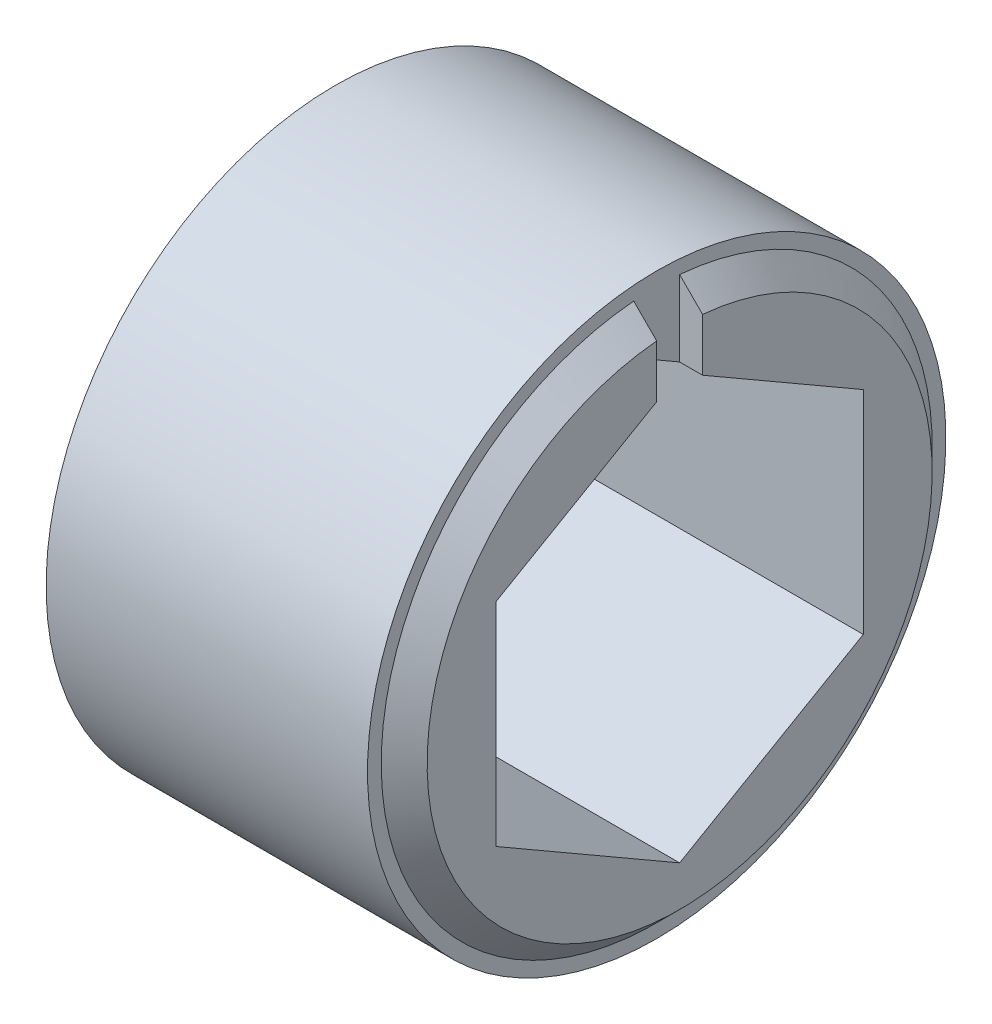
ISO-10303-21;
HEADER;
FILE_DESCRIPTION(('STEP AP214'),'2;1');
FILE_NAME('part.step','',(''),(''),'','','');
FILE_SCHEMA(('AUTOMOTIVE_DESIGN { 1 0 10303 214 1 1 1 1 }'));
ENDSEC;
DATA;
#1=APPLICATION_CONTEXT('core data for automotive mechanical design processes');
#2=APPLICATION_PROTOCOL_DEFINITION('international standard','automotive_design',2000,#1);
#3=PRODUCT_CONTEXT('',#1,'mechanical');
#4=PRODUCT('Part','Part','',(#3));
#5=PRODUCT_RELATED_PRODUCT_CATEGORY('part','',(#4));
#6=PRODUCT_DEFINITION_FORMATION('','',#4);
#7=PRODUCT_DEFINITION_CONTEXT('part definition',#1,'design');
#8=PRODUCT_DEFINITION('design','',#6,#7);
#9=PRODUCT_DEFINITION_SHAPE('','',#8);
#10=(LENGTH_UNIT() NAMED_UNIT(*) SI_UNIT(.MILLI.,.METRE.));
#11=(NAMED_UNIT(*) PLANE_ANGLE_UNIT() SI_UNIT($,.RADIAN.));
#12=(NAMED_UNIT(*) SI_UNIT($,.STERADIAN.) SOLID_ANGLE_UNIT());
#13=UNCERTAINTY_MEASURE_WITH_UNIT(LENGTH_MEASURE(1.E-05),#10,'distance_accuracy_value','');
#14=(GEOMETRIC_REPRESENTATION_CONTEXT(3) GLOBAL_UNCERTAINTY_ASSIGNED_CONTEXT((#13)) GLOBAL_UNIT_ASSIGNED_CONTEXT((#10,
#11,#12)) REPRESENTATION_CONTEXT('',''));
#15=CARTESIAN_POINT('',(0.,0.,0.));
#16=DIRECTION('',(0.,0.,1.));
#17=DIRECTION('',(1.,0.,0.));
#18=AXIS2_PLACEMENT_3D('',#15,#16,#17);
#19=CARTESIAN_POINT('',(6.35,0.,0.));
#20=DIRECTION('',(-1.,0.,0.));
#21=DIRECTION('',(0.,-1.,0.));
#22=AXIS2_PLACEMENT_3D('',#19,#20,#21);
#23=CONICAL_SURFACE('',#22,8.73125,0.785398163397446);
#24=CARTESIAN_POINT('',(6.35,0.,0.));
#25=DIRECTION('',(1.,0.,0.));
#26=DIRECTION('',(0.,1.,0.));
#27=AXIS2_PLACEMENT_3D('',#24,#25,#26);
#28=CIRCLE('',#27,8.73125);
#29=CARTESIAN_POINT('',(6.35,8.69509560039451,0.79375));
#30=VERTEX_POINT('',#29);
#31=CARTESIAN_POINT('',(6.35,8.69509560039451,-0.79375));
#32=VERTEX_POINT('',#31);
#33=EDGE_CURVE('E302',#30,#32,#28,.T.);
#34=ORIENTED_EDGE('',*,*,#33,.F.);
#35=CARTESIAN_POINT('',(-2378.57297857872,-2366.38302238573,0.79375));
#36=DIRECTION('',(0.,0.,1.));
#37=DIRECTION('',(0.708567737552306,0.705642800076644,0.));
#38=AXIS2_PLACEMENT_3D('',#35,#36,#37);
#39=CIRCLE('',#38,3365.83625274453);
#40=CARTESIAN_POINT('',(5.55625,9.49186946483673,0.79375));
#41=VERTEX_POINT('',#40);
#42=EDGE_CURVE('E254',#30,#41,#39,.T.);
#43=ORIENTED_EDGE('',*,*,#42,.T.);
#44=CARTESIAN_POINT('',(5.55625,0.,0.));
#45=DIRECTION('',(-1.,0.,0.));
#46=DIRECTION('',(0.,1.,0.));
#47=AXIS2_PLACEMENT_3D('',#44,#45,#46);
#48=CIRCLE('',#47,9.525);
#49=CARTESIAN_POINT('',(5.55625,9.49186946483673,-0.79375));
#50=VERTEX_POINT('',#49);
#51=EDGE_CURVE('E182',#50,#41,#48,.T.);
#52=ORIENTED_EDGE('',*,*,#51,.F.);
#53=CARTESIAN_POINT('',(-2378.57296923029,-2366.38301307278,-0.79375));
#54=DIRECTION('',(0.,0.,-1.));
#55=DIRECTION('',(0.708331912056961,0.705879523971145,0.));
#56=AXIS2_PLACEMENT_3D('',#53,#54,#55);
#57=CIRCLE('',#56,3365.83623954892);
#58=EDGE_CURVE('E173',#50,#32,#57,.T.);
#59=ORIENTED_EDGE('',*,*,#58,.T.);
#60=EDGE_LOOP('',(#34,#43,#52,#59));
#61=FACE_BOUND('',#60,.T.);
#62=ADVANCED_FACE('F17',(#61),#23,.T.);
#63=CARTESIAN_POINT('',(-6.36,0.,0.));
#64=DIRECTION('',(1.,0.,0.));
#65=DIRECTION('',(0.,1.,0.));
#66=AXIS2_PLACEMENT_3D('',#63,#64,#65);
#67=CYLINDRICAL_SURFACE('',#66,10.);
#68=CARTESIAN_POINT('',(-5.55625,0.,0.));
#69=DIRECTION('',(1.,0.,0.));
#70=DIRECTION('',(0.,1.,0.));
#71=AXIS2_PLACEMENT_3D('',#68,#69,#70);
#72=CIRCLE('',#71,10.);
#73=CARTESIAN_POINT('',(-5.55625,10.,0.));
#74=VERTEX_POINT('',#73);
#75=EDGE_CURVE('E156',#74,#74,#72,.T.);
#76=ORIENTED_EDGE('',*,*,#75,.T.);
#77=EDGE_LOOP('',(#76));
#78=FACE_BOUND('',#77,.T.);
#79=CARTESIAN_POINT('',(5.55625,0.,0.));
#80=DIRECTION('',(1.,0.,0.));
#81=DIRECTION('',(0.,1.,0.));
#82=AXIS2_PLACEMENT_3D('',#79,#80,#81);
#83=CIRCLE('',#82,10.);
#84=CARTESIAN_POINT('',(5.55625,10.,0.));
#85=VERTEX_POINT('',#84);
#86=EDGE_CURVE('E187',#85,#85,#83,.T.);
#87=ORIENTED_EDGE('',*,*,#86,.F.);
#88=EDGE_LOOP('',(#87));
#89=FACE_BOUND('',#88,.T.);
#90=ADVANCED_FACE('F157',(#78,#89),#67,.T.);
#91=CARTESIAN_POINT('',(-6.35,-3.66617420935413,6.35));
#92=DIRECTION('',(0.,-0.866025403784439,0.5));
#93=DIRECTION('',(-1.,0.,0.));
#94=AXIS2_PLACEMENT_3D('',#91,#92,#93);
#95=PLANE('',#94);
#96=DIRECTION('',(0.,-0.5,-0.866025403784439));
#97=VECTOR('',#96,1.);
#98=CARTESIAN_POINT('',(6.35,-3.66617420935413,6.35));
#99=LINE('',#98,#97);
#100=CARTESIAN_POINT('',(6.35,-3.66617420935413,6.35));
#101=VERTEX_POINT('',#100);
#102=CARTESIAN_POINT('',(6.35,-7.33234841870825,0.));
#103=VERTEX_POINT('',#102);
#104=EDGE_CURVE('E270',#101,#103,#99,.T.);
#105=ORIENTED_EDGE('',*,*,#104,.T.);
#106=DIRECTION('',(1.,0.,0.));
#107=VECTOR('',#106,1.);
#108=CARTESIAN_POINT('',(-6.35,-7.33234841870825,0.));
#109=LINE('',#108,#107);
#110=CARTESIAN_POINT('',(-6.35,-7.33234841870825,0.));
#111=VERTEX_POINT('',#110);
#112=EDGE_CURVE('E11',#111,#103,#109,.T.);
#113=ORIENTED_EDGE('',*,*,#112,.F.);
#114=DIRECTION('',(0.,-0.5,-0.866025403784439));
#115=VECTOR('',#114,1.);
#116=CARTESIAN_POINT('',(-6.35,-3.66617420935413,6.35));
#117=LINE('',#116,#115);
#118=CARTESIAN_POINT('',(-6.35,-3.66617420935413,6.35));
#119=VERTEX_POINT('',#118);
#120=EDGE_CURVE('E205',#119,#111,#117,.T.);
#121=ORIENTED_EDGE('',*,*,#120,.F.);
#122=DIRECTION('',(1.,0.,0.));
#123=VECTOR('',#122,1.);
#124=CARTESIAN_POINT('',(-6.35,-3.66617420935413,6.35));
#125=LINE('',#124,#123);
#126=EDGE_CURVE('E206',#119,#101,#125,.T.);
#127=ORIENTED_EDGE('',*,*,#126,.T.);
#128=EDGE_LOOP('',(#105,#113,#121,#127));
#129=FACE_BOUND('',#128,.T.);
#130=ADVANCED_FACE('F355',(#129),#95,.F.);
#131=CARTESIAN_POINT('',(-6.35,-7.33234841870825,0.));
#132=DIRECTION('',(0.,-0.866025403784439,-0.5));
#133=DIRECTION('',(0.,0.5,-0.866025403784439));
#134=AXIS2_PLACEMENT_3D('',#131,#132,#133);
#135=PLANE('',#134);
#136=DIRECTION('',(0.,0.5,-0.866025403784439));
#137=VECTOR('',#136,1.);
#138=CARTESIAN_POINT('',(6.35,-7.33234841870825,0.));
#139=LINE('',#138,#137);
#140=CARTESIAN_POINT('',(6.35,-3.66617420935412,-6.35));
#141=VERTEX_POINT('',#140);
#142=EDGE_CURVE('E267',#103,#141,#139,.T.);
#143=ORIENTED_EDGE('',*,*,#142,.T.);
#144=DIRECTION('',(1.,0.,0.));
#145=VECTOR('',#144,1.);
#146=CARTESIAN_POINT('',(-6.35,-3.66617420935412,-6.35));
#147=LINE('',#146,#145);
#148=CARTESIAN_POINT('',(-6.35,-3.66617420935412,-6.35));
#149=VERTEX_POINT('',#148);
#150=EDGE_CURVE('E25',#149,#141,#147,.T.);
#151=ORIENTED_EDGE('',*,*,#150,.F.);
#152=DIRECTION('',(0.,0.5,-0.866025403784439));
#153=VECTOR('',#152,1.);
#154=CARTESIAN_POINT('',(-6.35,-7.33234841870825,0.));
#155=LINE('',#154,#153);
#156=EDGE_CURVE('E293',#111,#149,#155,.T.);
#157=ORIENTED_EDGE('',*,*,#156,.F.);
#158=ORIENTED_EDGE('',*,*,#112,.T.);
#159=EDGE_LOOP('',(#143,#151,#157,#158));
#160=FACE_BOUND('',#159,.T.);
#161=ADVANCED_FACE('F360',(#160),#135,.F.);
#162=CARTESIAN_POINT('',(-6.35,-3.66617420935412,-6.35));
#163=DIRECTION('',(0.,0.,-1.));
#164=DIRECTION('',(-1.,0.,0.));
#165=AXIS2_PLACEMENT_3D('',#162,#163,#164);
#166=PLANE('',#165);
#167=DIRECTION('',(0.,1.,0.));
#168=VECTOR('',#167,1.);
#169=CARTESIAN_POINT('',(6.35,-3.66617420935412,-6.35));
#170=LINE('',#169,#168);
#171=CARTESIAN_POINT('',(6.35,3.66617420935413,-6.35));
#172=VERTEX_POINT('',#171);
#173=EDGE_CURVE('E271',#141,#172,#170,.T.);
#174=ORIENTED_EDGE('',*,*,#173,.T.);
#175=DIRECTION('',(1.,0.,0.));
#176=VECTOR('',#175,1.);
#177=CARTESIAN_POINT('',(-6.35,3.66617420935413,-6.35));
#178=LINE('',#177,#176);
#179=CARTESIAN_POINT('',(-6.35,3.66617420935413,-6.35));
#180=VERTEX_POINT('',#179);
#181=EDGE_CURVE('E278',#180,#172,#178,.T.);
#182=ORIENTED_EDGE('',*,*,#181,.F.);
#183=DIRECTION('',(0.,1.,0.));
#184=VECTOR('',#183,1.);
#185=CARTESIAN_POINT('',(-6.35,-3.66617420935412,-6.35));
#186=LINE('',#185,#184);
#187=EDGE_CURVE('E281',#149,#180,#186,.T.);
#188=ORIENTED_EDGE('',*,*,#187,.F.);
#189=ORIENTED_EDGE('',*,*,#150,.T.);
#190=EDGE_LOOP('',(#174,#182,#188,#189));
#191=FACE_BOUND('',#190,.T.);
#192=ADVANCED_FACE('F321',(#191),#166,.F.);
#193=CARTESIAN_POINT('',(-6.35,0.,0.));
#194=DIRECTION('',(1.,0.,0.));
#195=DIRECTION('',(0.,1.,0.));
#196=AXIS2_PLACEMENT_3D('',#193,#194,#195);
#197=PLANE('',#196);
#198=DIRECTION('',(0.,0.5,0.866025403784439));
#199=VECTOR('',#198,1.);
#200=CARTESIAN_POINT('',(-6.35,3.66617420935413,-6.35));
#201=LINE('',#200,#199);
#202=CARTESIAN_POINT('',(-6.35,6.87407664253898,-0.79375));
#203=VERTEX_POINT('',#202);
#204=EDGE_CURVE('E275',#180,#203,#201,.T.);
#205=ORIENTED_EDGE('',*,*,#204,.T.);
#206=DIRECTION('',(0.,-1.,0.));
#207=VECTOR('',#206,1.);
#208=CARTESIAN_POINT('',(-6.35,6.87407664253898,-0.79375));
#209=LINE('',#208,#207);
#210=CARTESIAN_POINT('',(-6.35,8.69509560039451,-0.79375));
#211=VERTEX_POINT('',#210);
#212=EDGE_CURVE('E192',#211,#203,#209,.T.);
#213=ORIENTED_EDGE('',*,*,#212,.F.);
#214=CARTESIAN_POINT('',(-6.35,0.,0.));
#215=DIRECTION('',(1.,0.,0.));
#216=DIRECTION('',(0.,1.,0.));
#217=AXIS2_PLACEMENT_3D('',#214,#215,#216);
#218=CIRCLE('',#217,8.73125);
#219=CARTESIAN_POINT('',(-6.35,8.69509560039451,0.79375));
#220=VERTEX_POINT('',#219);
#221=EDGE_CURVE('E210',#220,#211,#218,.T.);
#222=ORIENTED_EDGE('',*,*,#221,.F.);
#223=DIRECTION('',(0.,1.,0.));
#224=VECTOR('',#223,1.);
#225=CARTESIAN_POINT('',(-6.35,6.87407664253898,0.79375));
#226=LINE('',#225,#224);
#227=CARTESIAN_POINT('',(-6.35,6.87407664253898,0.79375));
#228=VERTEX_POINT('',#227);
#229=EDGE_CURVE('E175',#228,#220,#226,.T.);
#230=ORIENTED_EDGE('',*,*,#229,.F.);
#231=DIRECTION('',(0.,-0.5,0.866025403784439));
#232=VECTOR('',#231,1.);
#233=CARTESIAN_POINT('',(-6.35,7.33234841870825,0.));
#234=LINE('',#233,#232);
#235=CARTESIAN_POINT('',(-6.35,3.66617420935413,6.35));
#236=VERTEX_POINT('',#235);
#237=EDGE_CURVE('E246',#228,#236,#234,.T.);
#238=ORIENTED_EDGE('',*,*,#237,.T.);
#239=DIRECTION('',(0.,-1.,0.));
#240=VECTOR('',#239,1.);
#241=CARTESIAN_POINT('',(-6.35,3.66617420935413,6.35));
#242=LINE('',#241,#240);
#243=EDGE_CURVE('E201',#236,#119,#242,.T.);
#244=ORIENTED_EDGE('',*,*,#243,.T.);
#245=ORIENTED_EDGE('',*,*,#120,.T.);
#246=ORIENTED_EDGE('',*,*,#156,.T.);
#247=ORIENTED_EDGE('',*,*,#187,.T.);
#248=EDGE_LOOP('',(#205,#213,#222,#230,#238,#244,#245,#246,#247));
#249=FACE_BOUND('',#248,.T.);
#250=ADVANCED_FACE('F318',(#249),#197,.F.);
#251=CARTESIAN_POINT('',(-6.35,3.66617420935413,6.35));
#252=DIRECTION('',(0.,0.,1.));
#253=DIRECTION('',(1.,0.,0.));
#254=AXIS2_PLACEMENT_3D('',#251,#252,#253);
#255=PLANE('',#254);
#256=DIRECTION('',(0.,-1.,0.));
#257=VECTOR('',#256,1.);
#258=CARTESIAN_POINT('',(6.35,3.66617420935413,6.35));
#259=LINE('',#258,#257);
#260=CARTESIAN_POINT('',(6.35,3.66617420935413,6.35));
#261=VERTEX_POINT('',#260);
#262=EDGE_CURVE('E241',#261,#101,#259,.T.);
#263=ORIENTED_EDGE('',*,*,#262,.T.);
#264=ORIENTED_EDGE('',*,*,#126,.F.);
#265=ORIENTED_EDGE('',*,*,#243,.F.);
#266=DIRECTION('',(1.,0.,0.));
#267=VECTOR('',#266,1.);
#268=CARTESIAN_POINT('',(-6.35,3.66617420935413,6.35));
#269=LINE('',#268,#267);
#270=EDGE_CURVE('E242',#236,#261,#269,.T.);
#271=ORIENTED_EDGE('',*,*,#270,.T.);
#272=EDGE_LOOP('',(#263,#264,#265,#271));
#273=FACE_BOUND('',#272,.T.);
#274=ADVANCED_FACE('F353',(#273),#255,.F.);
#275=CARTESIAN_POINT('',(6.35,0.,0.));
#276=DIRECTION('',(1.,0.,0.));
#277=DIRECTION('',(0.,1.,0.));
#278=AXIS2_PLACEMENT_3D('',#275,#276,#277);
#279=PLANE('',#278);
#280=DIRECTION('',(0.,-1.,0.));
#281=VECTOR('',#280,1.);
#282=CARTESIAN_POINT('',(6.35,6.87407664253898,0.79375));
#283=LINE('',#282,#281);
#284=CARTESIAN_POINT('',(6.35,6.87407664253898,0.79375));
#285=VERTEX_POINT('',#284);
#286=EDGE_CURVE('E227',#30,#285,#283,.T.);
#287=ORIENTED_EDGE('',*,*,#286,.F.);
#288=ORIENTED_EDGE('',*,*,#33,.T.);
#289=DIRECTION('',(0.,1.,0.));
#290=VECTOR('',#289,1.);
#291=CARTESIAN_POINT('',(6.35,6.87407664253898,-0.79375));
#292=LINE('',#291,#290);
#293=CARTESIAN_POINT('',(6.35,6.87407664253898,-0.79375));
#294=VERTEX_POINT('',#293);
#295=EDGE_CURVE('E176',#294,#32,#292,.T.);
#296=ORIENTED_EDGE('',*,*,#295,.F.);
#297=DIRECTION('',(0.,0.5,0.866025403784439));
#298=VECTOR('',#297,1.);
#299=CARTESIAN_POINT('',(6.35,3.66617420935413,-6.35));
#300=LINE('',#299,#298);
#301=EDGE_CURVE('E285',#172,#294,#300,.T.);
#302=ORIENTED_EDGE('',*,*,#301,.F.);
#303=ORIENTED_EDGE('',*,*,#173,.F.);
#304=ORIENTED_EDGE('',*,*,#142,.F.);
#305=ORIENTED_EDGE('',*,*,#104,.F.);
#306=ORIENTED_EDGE('',*,*,#262,.F.);
#307=DIRECTION('',(0.,-0.5,0.866025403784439));
#308=VECTOR('',#307,1.);
#309=CARTESIAN_POINT('',(6.35,7.33234841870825,0.));
#310=LINE('',#309,#308);
#311=EDGE_CURVE('E247',#285,#261,#310,.T.);
#312=ORIENTED_EDGE('',*,*,#311,.F.);
#313=EDGE_LOOP('',(#287,#288,#296,#302,#303,#304,#305,#306,#312));
#314=FACE_BOUND('',#313,.T.);
#315=ADVANCED_FACE('F359',(#314),#279,.T.);
#316=CARTESIAN_POINT('',(-2.46633885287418,6.87407664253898,0.79375));
#317=DIRECTION('',(0.,0.,1.));
#318=DIRECTION('',(1.,0.,0.));
#319=AXIS2_PLACEMENT_3D('',#316,#317,#318);
#320=PLANE('',#319);
#321=DIRECTION('',(0.,1.,0.));
#322=VECTOR('',#321,1.);
#323=CARTESIAN_POINT('',(-5.55625,6.87407664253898,0.79375));
#324=LINE('',#323,#322);
#325=CARTESIAN_POINT('',(-5.55625,6.87407664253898,0.79375));
#326=VERTEX_POINT('',#325);
#327=CARTESIAN_POINT('',(-5.55625,9.49186946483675,0.79375));
#328=VERTEX_POINT('',#327);
#329=EDGE_CURVE('E172',#326,#328,#324,.T.);
#330=ORIENTED_EDGE('',*,*,#329,.F.);
#331=DIRECTION('',(-1.,0.,0.));
#332=VECTOR('',#331,1.);
#333=CARTESIAN_POINT('',(-2.46633885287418,6.87407664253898,0.79375));
#334=LINE('',#333,#332);
#335=EDGE_CURVE('E257',#326,#228,#334,.T.);
#336=ORIENTED_EDGE('',*,*,#335,.T.);
#337=ORIENTED_EDGE('',*,*,#229,.T.);
#338=CARTESIAN_POINT('',(2378.57294995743,-2366.38299387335,0.79375));
#339=DIRECTION('',(0.,0.,1.));
#340=DIRECTION('',(-0.708331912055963,0.705879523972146,0.));
#341=AXIS2_PLACEMENT_3D('',#338,#339,#340);
#342=CIRCLE('',#341,3365.83621234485);
#343=EDGE_CURVE('E197',#328,#220,#342,.T.);
#344=ORIENTED_EDGE('',*,*,#343,.F.);
#345=EDGE_LOOP('',(#330,#336,#337,#344));
#346=FACE_BOUND('',#345,.T.);
#347=ADVANCED_FACE('F339',(#346),#320,.F.);
#348=CARTESIAN_POINT('',(2.46633885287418,6.87407664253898,-0.79375));
#349=DIRECTION('',(0.,0.,-1.));
#350=DIRECTION('',(0.,-1.,0.));
#351=AXIS2_PLACEMENT_3D('',#348,#349,#350);
#352=PLANE('',#351);
#353=DIRECTION('',(0.,-1.,0.));
#354=VECTOR('',#353,1.);
#355=CARTESIAN_POINT('',(5.55625,6.87407664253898,-0.79375));
#356=LINE('',#355,#354);
#357=CARTESIAN_POINT('',(5.55625,6.87407664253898,-0.79375));
#358=VERTEX_POINT('',#357);
#359=EDGE_CURVE('E232',#50,#358,#356,.T.);
#360=ORIENTED_EDGE('',*,*,#359,.T.);
#361=DIRECTION('',(1.,0.,0.));
#362=VECTOR('',#361,1.);
#363=CARTESIAN_POINT('',(2.46633885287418,6.87407664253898,-0.79375));
#364=LINE('',#363,#362);
#365=EDGE_CURVE('E289',#358,#294,#364,.T.);
#366=ORIENTED_EDGE('',*,*,#365,.T.);
#367=ORIENTED_EDGE('',*,*,#295,.T.);
#368=ORIENTED_EDGE('',*,*,#58,.F.);
#369=EDGE_LOOP('',(#360,#366,#367,#368));
#370=FACE_BOUND('',#369,.T.);
#371=ADVANCED_FACE('F389',(#370),#352,.F.);
#372=CARTESIAN_POINT('',(-6.35,3.66617420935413,-6.35));
#373=DIRECTION('',(0.,0.866025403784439,-0.5));
#374=DIRECTION('',(-1.,0.,0.));
#375=AXIS2_PLACEMENT_3D('',#372,#373,#374);
#376=PLANE('',#375);
#377=DIRECTION('',(1.,0.,0.));
#378=VECTOR('',#377,1.);
#379=CARTESIAN_POINT('',(-6.35,7.33234841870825,0.));
#380=LINE('',#379,#378);
#381=CARTESIAN_POINT('',(-5.55625,7.33234841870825,0.));
#382=VERTEX_POINT('',#381);
#383=CARTESIAN_POINT('',(5.55625,7.33234841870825,0.));
#384=VERTEX_POINT('',#383);
#385=EDGE_CURVE('E261',#382,#384,#380,.T.);
#386=ORIENTED_EDGE('',*,*,#385,.F.);
#387=DIRECTION('',(0.,-0.5,-0.866025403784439));
#388=VECTOR('',#387,1.);
#389=CARTESIAN_POINT('',(-5.55625,3.66617420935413,-6.35));
#390=LINE('',#389,#388);
#391=CARTESIAN_POINT('',(-5.55625,6.87407664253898,-0.79375));
#392=VERTEX_POINT('',#391);
#393=EDGE_CURVE('E181',#382,#392,#390,.T.);
#394=ORIENTED_EDGE('',*,*,#393,.T.);
#395=DIRECTION('',(-1.,0.,0.));
#396=VECTOR('',#395,1.);
#397=CARTESIAN_POINT('',(-2.46633885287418,6.87407664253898,-0.79375));
#398=LINE('',#397,#396);
#399=EDGE_CURVE('E196',#392,#203,#398,.T.);
#400=ORIENTED_EDGE('',*,*,#399,.T.);
#401=ORIENTED_EDGE('',*,*,#204,.F.);
#402=ORIENTED_EDGE('',*,*,#181,.T.);
#403=ORIENTED_EDGE('',*,*,#301,.T.);
#404=ORIENTED_EDGE('',*,*,#365,.F.);
#405=DIRECTION('',(0.,-0.5,-0.866025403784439));
#406=VECTOR('',#405,1.);
#407=CARTESIAN_POINT('',(5.55625,3.66617420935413,-6.35));
#408=LINE('',#407,#406);
#409=EDGE_CURVE('E224',#384,#358,#408,.T.);
#410=ORIENTED_EDGE('',*,*,#409,.F.);
#411=EDGE_LOOP('',(#386,#394,#400,#401,#402,#403,#404,#410));
#412=FACE_BOUND('',#411,.T.);
#413=ADVANCED_FACE('F325',(#412),#376,.F.);
#414=CARTESIAN_POINT('',(-6.35,7.33234841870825,0.));
#415=DIRECTION('',(0.,0.866025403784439,0.5));
#416=DIRECTION('',(1.,0.,0.));
#417=AXIS2_PLACEMENT_3D('',#414,#415,#416);
#418=PLANE('',#417);
#419=ORIENTED_EDGE('',*,*,#335,.F.);
#420=DIRECTION('',(0.,0.5,-0.866025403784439));
#421=VECTOR('',#420,1.);
#422=CARTESIAN_POINT('',(-5.55625,7.33234841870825,0.));
#423=LINE('',#422,#421);
#424=EDGE_CURVE('E191',#326,#382,#423,.T.);
#425=ORIENTED_EDGE('',*,*,#424,.T.);
#426=ORIENTED_EDGE('',*,*,#385,.T.);
#427=DIRECTION('',(0.,0.5,-0.866025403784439));
#428=VECTOR('',#427,1.);
#429=CARTESIAN_POINT('',(5.55625,7.33234841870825,0.));
#430=LINE('',#429,#428);
#431=CARTESIAN_POINT('',(5.55625,6.87407664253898,0.79375));
#432=VERTEX_POINT('',#431);
#433=EDGE_CURVE('E220',#432,#384,#430,.T.);
#434=ORIENTED_EDGE('',*,*,#433,.F.);
#435=DIRECTION('',(1.,0.,0.));
#436=VECTOR('',#435,1.);
#437=CARTESIAN_POINT('',(2.46633885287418,6.87407664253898,0.79375));
#438=LINE('',#437,#436);
#439=EDGE_CURVE('E231',#432,#285,#438,.T.);
#440=ORIENTED_EDGE('',*,*,#439,.T.);
#441=ORIENTED_EDGE('',*,*,#311,.T.);
#442=ORIENTED_EDGE('',*,*,#270,.F.);
#443=ORIENTED_EDGE('',*,*,#237,.F.);
#444=EDGE_LOOP('',(#419,#425,#426,#434,#440,#441,#442,#443));
#445=FACE_BOUND('',#444,.T.);
#446=ADVANCED_FACE('F347',(#445),#418,.F.);
#447=CARTESIAN_POINT('',(2.46633885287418,6.87407664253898,0.79375));
#448=DIRECTION('',(0.,0.,1.));
#449=DIRECTION('',(1.,0.,0.));
#450=AXIS2_PLACEMENT_3D('',#447,#448,#449);
#451=PLANE('',#450);
#452=ORIENTED_EDGE('',*,*,#286,.T.);
#453=ORIENTED_EDGE('',*,*,#439,.F.);
#454=DIRECTION('',(0.,1.,0.));
#455=VECTOR('',#454,1.);
#456=CARTESIAN_POINT('',(5.55625,6.87407664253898,0.79375));
#457=LINE('',#456,#455);
#458=EDGE_CURVE('E186',#432,#41,#457,.T.);
#459=ORIENTED_EDGE('',*,*,#458,.T.);
#460=ORIENTED_EDGE('',*,*,#42,.F.);
#461=EDGE_LOOP('',(#452,#453,#459,#460));
#462=FACE_BOUND('',#461,.T.);
#463=ADVANCED_FACE('F382',(#462),#451,.F.);
#464=CARTESIAN_POINT('',(5.55625,0.,0.));
#465=DIRECTION('',(1.,0.,0.));
#466=DIRECTION('',(0.,1.,0.));
#467=AXIS2_PLACEMENT_3D('',#464,#465,#466);
#468=PLANE('',#467);
#469=ORIENTED_EDGE('',*,*,#51,.T.);
#470=ORIENTED_EDGE('',*,*,#458,.F.);
#471=ORIENTED_EDGE('',*,*,#433,.T.);
#472=ORIENTED_EDGE('',*,*,#409,.T.);
#473=ORIENTED_EDGE('',*,*,#359,.F.);
#474=EDGE_LOOP('',(#469,#470,#471,#472,#473));
#475=FACE_BOUND('',#474,.T.);
#476=ORIENTED_EDGE('',*,*,#86,.T.);
#477=EDGE_LOOP('',(#476));
#478=FACE_BOUND('',#477,.T.);
#479=ADVANCED_FACE('F385',(#475,#478),#468,.T.);
#480=CARTESIAN_POINT('',(-2.46633885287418,6.87407664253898,-0.79375));
#481=DIRECTION('',(0.,0.,-1.));
#482=DIRECTION('',(0.,-1.,0.));
#483=AXIS2_PLACEMENT_3D('',#480,#481,#482);
#484=PLANE('',#483);
#485=ORIENTED_EDGE('',*,*,#212,.T.);
#486=ORIENTED_EDGE('',*,*,#399,.F.);
#487=DIRECTION('',(0.,-1.,0.));
#488=VECTOR('',#487,1.);
#489=CARTESIAN_POINT('',(-5.55625,6.87407664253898,-0.79375));
#490=LINE('',#489,#488);
#491=CARTESIAN_POINT('',(-5.55625,9.49186946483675,-0.79375));
#492=VERTEX_POINT('',#491);
#493=EDGE_CURVE('E168',#492,#392,#490,.T.);
#494=ORIENTED_EDGE('',*,*,#493,.F.);
#495=CARTESIAN_POINT('',(2378.57299746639,-2366.38304120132,-0.79375));
#496=DIRECTION('',(0.,0.,-1.));
#497=DIRECTION('',(-0.708567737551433,0.705642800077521,0.));
#498=AXIS2_PLACEMENT_3D('',#495,#496,#497);
#499=CIRCLE('',#498,3365.8362794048);
#500=EDGE_CURVE('E207',#211,#492,#499,.T.);
#501=ORIENTED_EDGE('',*,*,#500,.F.);
#502=EDGE_LOOP('',(#485,#486,#494,#501));
#503=FACE_BOUND('',#502,.T.);
#504=ADVANCED_FACE('F330',(#503),#484,.F.);
#505=CARTESIAN_POINT('',(-5.55625,0.,0.));
#506=DIRECTION('',(1.,0.,0.));
#507=DIRECTION('',(0.,1.,0.));
#508=AXIS2_PLACEMENT_3D('',#505,#506,#507);
#509=CONICAL_SURFACE('',#508,9.525,0.785398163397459);
#510=ORIENTED_EDGE('',*,*,#221,.T.);
#511=ORIENTED_EDGE('',*,*,#500,.T.);
#512=CARTESIAN_POINT('',(-5.55625,0.,0.));
#513=DIRECTION('',(1.,0.,0.));
#514=DIRECTION('',(0.,1.,0.));
#515=AXIS2_PLACEMENT_3D('',#512,#513,#514);
#516=CIRCLE('',#515,9.525);
#517=EDGE_CURVE('E161',#328,#492,#516,.T.);
#518=ORIENTED_EDGE('',*,*,#517,.F.);
#519=ORIENTED_EDGE('',*,*,#343,.T.);
#520=EDGE_LOOP('',(#510,#511,#518,#519));
#521=FACE_BOUND('',#520,.T.);
#522=ADVANCED_FACE('F334',(#521),#509,.T.);
#523=CARTESIAN_POINT('',(-5.55625,0.,0.));
#524=DIRECTION('',(1.,0.,0.));
#525=DIRECTION('',(0.,1.,0.));
#526=AXIS2_PLACEMENT_3D('',#523,#524,#525);
#527=PLANE('',#526);
#528=ORIENTED_EDGE('',*,*,#517,.T.);
#529=ORIENTED_EDGE('',*,*,#493,.T.);
#530=ORIENTED_EDGE('',*,*,#393,.F.);
#531=ORIENTED_EDGE('',*,*,#424,.F.);
#532=ORIENTED_EDGE('',*,*,#329,.T.);
#533=EDGE_LOOP('',(#528,#529,#530,#531,#532));
#534=FACE_BOUND('',#533,.T.);
#535=ORIENTED_EDGE('',*,*,#75,.F.);
#536=EDGE_LOOP('',(#535));
#537=FACE_BOUND('',#536,.T.);
#538=ADVANCED_FACE('F342',(#534,#537),#527,.F.);
#539=CLOSED_SHELL('',(#62,#90,#130,#161,#192,#250,#274,#315,#347,#371,#413,#446,#463,#479,#504,
#522,#538));
#540=MANIFOLD_SOLID_BREP('B1',#539);
#541=ADVANCED_BREP_SHAPE_REPRESENTATION('',(#18,#540),#14);
#542=SHAPE_DEFINITION_REPRESENTATION(#9,#541);
ENDSEC;
END-ISO-10303-21;
